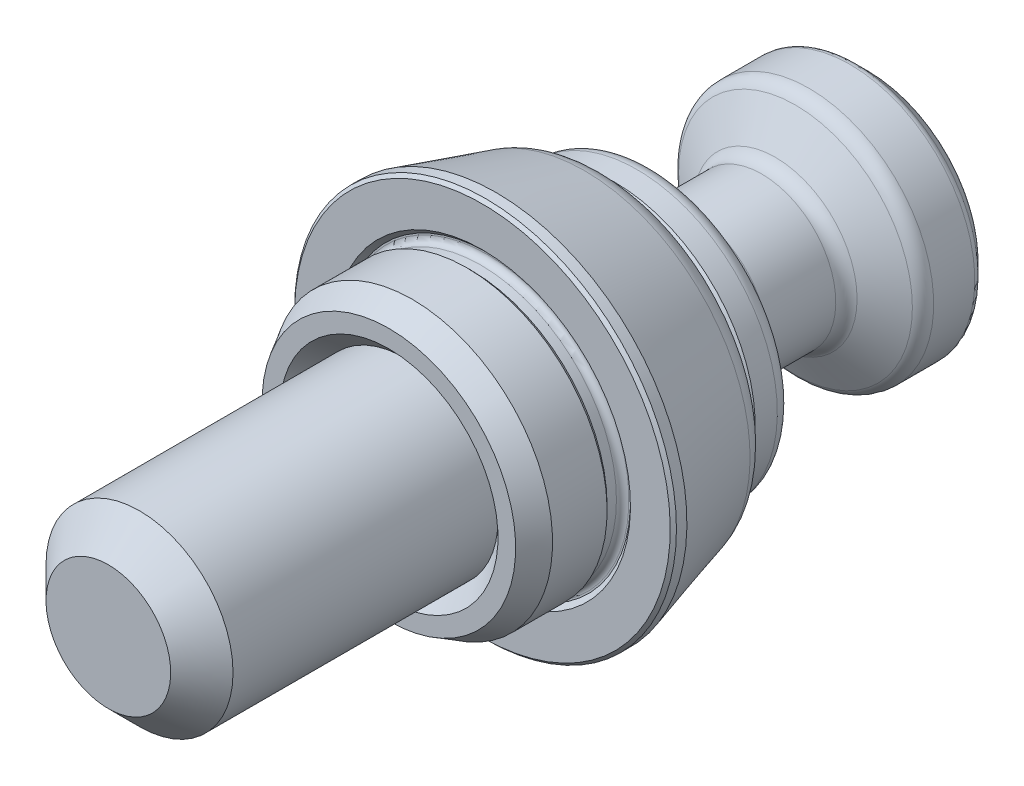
ISO-10303-21;
HEADER;
FILE_DESCRIPTION(('STEP AP214'),'2;1');
FILE_NAME('part.step','',(''),(''),'','','');
FILE_SCHEMA(('AUTOMOTIVE_DESIGN { 1 0 10303 214 1 1 1 1 }'));
ENDSEC;
DATA;
#1=APPLICATION_CONTEXT('core data for automotive mechanical design processes');
#2=APPLICATION_PROTOCOL_DEFINITION('international standard','automotive_design',2000,#1);
#3=PRODUCT_CONTEXT('',#1,'mechanical');
#4=PRODUCT('Part','Part','',(#3));
#5=PRODUCT_RELATED_PRODUCT_CATEGORY('part','',(#4));
#6=PRODUCT_DEFINITION_FORMATION('','',#4);
#7=PRODUCT_DEFINITION_CONTEXT('part definition',#1,'design');
#8=PRODUCT_DEFINITION('design','',#6,#7);
#9=PRODUCT_DEFINITION_SHAPE('','',#8);
#10=(LENGTH_UNIT() NAMED_UNIT(*) SI_UNIT(.MILLI.,.METRE.));
#11=(NAMED_UNIT(*) PLANE_ANGLE_UNIT() SI_UNIT($,.RADIAN.));
#12=(NAMED_UNIT(*) SI_UNIT($,.STERADIAN.) SOLID_ANGLE_UNIT());
#13=UNCERTAINTY_MEASURE_WITH_UNIT(LENGTH_MEASURE(1.E-05),#10,'distance_accuracy_value','');
#14=(GEOMETRIC_REPRESENTATION_CONTEXT(3) GLOBAL_UNCERTAINTY_ASSIGNED_CONTEXT((#13)) GLOBAL_UNIT_ASSIGNED_CONTEXT((#10,
#11,#12)) REPRESENTATION_CONTEXT('',''));
#15=CARTESIAN_POINT('',(0.,0.,0.));
#16=DIRECTION('',(0.,0.,1.));
#17=DIRECTION('',(1.,0.,0.));
#18=AXIS2_PLACEMENT_3D('',#15,#16,#17);
#19=CARTESIAN_POINT('',(6.,0.,-8.));
#20=DIRECTION('',(0.,0.,-1.));
#21=DIRECTION('',(0.,1.,0.));
#22=AXIS2_PLACEMENT_3D('',#19,#20,#21);
#23=PLANE('',#22);
#24=CARTESIAN_POINT('',(0.,0.,-8.));
#25=DIRECTION('',(0.,0.,1.));
#26=DIRECTION('',(0.,1.,0.));
#27=AXIS2_PLACEMENT_3D('',#24,#25,#26);
#28=CIRCLE('',#27,8.5);
#29=CARTESIAN_POINT('',(0.,8.5,-8.));
#30=VERTEX_POINT('',#29);
#31=EDGE_CURVE('E91',#30,#30,#28,.T.);
#32=ORIENTED_EDGE('',*,*,#31,.T.);
#33=EDGE_LOOP('',(#32));
#34=FACE_BOUND('',#33,.T.);
#35=CARTESIAN_POINT('',(0.,0.,-8.));
#36=DIRECTION('',(0.,0.,-1.));
#37=DIRECTION('',(0.,1.,0.));
#38=AXIS2_PLACEMENT_3D('',#35,#36,#37);
#39=CIRCLE('',#38,8.69892881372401);
#40=CARTESIAN_POINT('',(0.,8.69892881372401,-8.));
#41=VERTEX_POINT('',#40);
#42=EDGE_CURVE('E166',#41,#41,#39,.T.);
#43=ORIENTED_EDGE('',*,*,#42,.T.);
#44=EDGE_LOOP('',(#43));
#45=FACE_BOUND('',#44,.T.);
#46=ADVANCED_FACE('F14',(#34,#45),#23,.T.);
#47=CARTESIAN_POINT('',(0.,0.,-6.));
#48=DIRECTION('',(0.,0.,-1.));
#49=DIRECTION('',(0.,1.,0.));
#50=AXIS2_PLACEMENT_3D('',#47,#48,#49);
#51=TOROIDAL_SURFACE('',#50,8.69892881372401,2.);
#52=CARTESIAN_POINT('',(0.,0.,-6.55127471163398));
#53=DIRECTION('',(0.,0.,-1.));
#54=DIRECTION('',(0.,1.,0.));
#55=AXIS2_PLACEMENT_3D('',#52,#53,#54);
#56=CIRCLE('',#55,10.6214522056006);
#57=CARTESIAN_POINT('',(0.,10.6214522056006,-6.55127471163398));
#58=VERTEX_POINT('',#57);
#59=EDGE_CURVE('E169',#58,#58,#56,.F.);
#60=ORIENTED_EDGE('',*,*,#59,.F.);
#61=EDGE_LOOP('',(#60));
#62=FACE_BOUND('',#61,.T.);
#63=ORIENTED_EDGE('',*,*,#42,.F.);
#64=EDGE_LOOP('',(#63));
#65=FACE_BOUND('',#64,.T.);
#66=ADVANCED_FACE('F308',(#62,#65),#51,.T.);
#67=CARTESIAN_POINT('',(0.,0.,-8.));
#68=DIRECTION('',(0.,0.,1.));
#69=DIRECTION('',(0.,-1.,0.));
#70=AXIS2_PLACEMENT_3D('',#67,#68,#69);
#71=CONICAL_SURFACE('',#70,10.2060369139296,0.279252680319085);
#72=ORIENTED_EDGE('',*,*,#59,.T.);
#73=EDGE_LOOP('',(#72));
#74=FACE_BOUND('',#73,.T.);
#75=CARTESIAN_POINT('',(0.,0.,-0.871853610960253));
#76=DIRECTION('',(0.,0.,-1.));
#77=DIRECTION('',(0.,1.,0.));
#78=AXIS2_PLACEMENT_3D('',#75,#76,#77);
#79=CIRCLE('',#78,12.25);
#80=CARTESIAN_POINT('',(0.,12.25,-0.871853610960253));
#81=VERTEX_POINT('',#80);
#82=EDGE_CURVE('E163',#81,#81,#79,.T.);
#83=ORIENTED_EDGE('',*,*,#82,.T.);
#84=EDGE_LOOP('',(#83));
#85=FACE_BOUND('',#84,.T.);
#86=ADVANCED_FACE('F312',(#74,#85),#71,.T.);
#87=CARTESIAN_POINT('',(0.,0.,0.));
#88=DIRECTION('',(0.,0.,-1.));
#89=DIRECTION('',(0.,1.,0.));
#90=AXIS2_PLACEMENT_3D('',#87,#88,#89);
#91=CYLINDRICAL_SURFACE('',#90,12.25);
#92=CARTESIAN_POINT('',(0.,0.,-0.2));
#93=DIRECTION('',(0.,0.,1.));
#94=DIRECTION('',(0.,-1.,0.));
#95=AXIS2_PLACEMENT_3D('',#92,#93,#94);
#96=CIRCLE('',#95,12.25);
#97=CARTESIAN_POINT('',(0.,-12.25,-0.2));
#98=VERTEX_POINT('',#97);
#99=EDGE_CURVE('E181',#98,#98,#96,.F.);
#100=ORIENTED_EDGE('',*,*,#99,.T.);
#101=EDGE_LOOP('',(#100));
#102=FACE_BOUND('',#101,.T.);
#103=ORIENTED_EDGE('',*,*,#82,.F.);
#104=EDGE_LOOP('',(#103));
#105=FACE_BOUND('',#104,.T.);
#106=ADVANCED_FACE('F315',(#102,#105),#91,.T.);
#107=CARTESIAN_POINT('',(0.,0.,-0.2));
#108=DIRECTION('',(0.,0.,-1.));
#109=DIRECTION('',(0.,1.,0.));
#110=AXIS2_PLACEMENT_3D('',#107,#108,#109);
#111=CONICAL_SURFACE('',#110,12.25,0.785398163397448);
#112=CARTESIAN_POINT('',(0.,0.,0.));
#113=DIRECTION('',(0.,0.,1.));
#114=DIRECTION('',(0.,-1.,0.));
#115=AXIS2_PLACEMENT_3D('',#112,#113,#114);
#116=CIRCLE('',#115,12.05);
#117=CARTESIAN_POINT('',(0.,-12.05,0.));
#118=VERTEX_POINT('',#117);
#119=EDGE_CURVE('E184',#118,#118,#116,.T.);
#120=ORIENTED_EDGE('',*,*,#119,.F.);
#121=EDGE_LOOP('',(#120));
#122=FACE_BOUND('',#121,.T.);
#123=ORIENTED_EDGE('',*,*,#99,.F.);
#124=EDGE_LOOP('',(#123));
#125=FACE_BOUND('',#124,.T.);
#126=ADVANCED_FACE('F303',(#122,#125),#111,.T.);
#127=CARTESIAN_POINT('',(9.,0.,0.));
#128=DIRECTION('',(0.,0.,1.));
#129=DIRECTION('',(0.,-1.,0.));
#130=AXIS2_PLACEMENT_3D('',#127,#128,#129);
#131=PLANE('',#130);
#132=CARTESIAN_POINT('',(0.,0.,0.));
#133=DIRECTION('',(0.,0.,-1.));
#134=DIRECTION('',(0.,1.,0.));
#135=AXIS2_PLACEMENT_3D('',#132,#133,#134);
#136=CIRCLE('',#135,9.5);
#137=CARTESIAN_POINT('',(0.,9.5,0.));
#138=VERTEX_POINT('',#137);
#139=EDGE_CURVE('E160',#138,#138,#136,.T.);
#140=ORIENTED_EDGE('',*,*,#139,.T.);
#141=EDGE_LOOP('',(#140));
#142=FACE_BOUND('',#141,.T.);
#143=ORIENTED_EDGE('',*,*,#119,.T.);
#144=EDGE_LOOP('',(#143));
#145=FACE_BOUND('',#144,.T.);
#146=ADVANCED_FACE('F292',(#142,#145),#131,.T.);
#147=CARTESIAN_POINT('',(0.,0.,-0.3));
#148=DIRECTION('',(0.,0.,1.));
#149=DIRECTION('',(0.,-1.,0.));
#150=AXIS2_PLACEMENT_3D('',#147,#148,#149);
#151=CONICAL_SURFACE('',#150,9.2,0.785398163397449);
#152=ORIENTED_EDGE('',*,*,#139,.F.);
#153=EDGE_LOOP('',(#152));
#154=FACE_BOUND('',#153,.T.);
#155=CARTESIAN_POINT('',(0.,0.,-0.3));
#156=DIRECTION('',(0.,0.,-1.));
#157=DIRECTION('',(0.,1.,0.));
#158=AXIS2_PLACEMENT_3D('',#155,#156,#157);
#159=CIRCLE('',#158,9.2);
#160=CARTESIAN_POINT('',(0.,9.2,-0.3));
#161=VERTEX_POINT('',#160);
#162=EDGE_CURVE('E157',#161,#161,#159,.T.);
#163=ORIENTED_EDGE('',*,*,#162,.T.);
#164=EDGE_LOOP('',(#163));
#165=FACE_BOUND('',#164,.T.);
#166=ADVANCED_FACE('F277',(#154,#165),#151,.F.);
#167=CARTESIAN_POINT('',(0.,0.,6.));
#168=DIRECTION('',(0.,0.,1.));
#169=DIRECTION('',(0.,-1.,0.));
#170=AXIS2_PLACEMENT_3D('',#167,#168,#169);
#171=CONICAL_SURFACE('',#170,7.,0.785398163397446);
#172=CARTESIAN_POINT('',(0.,0.,5.));
#173=DIRECTION('',(0.,0.,1.));
#174=DIRECTION('',(0.,-1.,0.));
#175=AXIS2_PLACEMENT_3D('',#172,#173,#174);
#176=CIRCLE('',#175,6.);
#177=CARTESIAN_POINT('',(0.,-6.,5.));
#178=VERTEX_POINT('',#177);
#179=EDGE_CURVE('E9',#178,#178,#176,.F.);
#180=ORIENTED_EDGE('',*,*,#179,.T.);
#181=EDGE_LOOP('',(#180));
#182=FACE_BOUND('',#181,.T.);
#183=CARTESIAN_POINT('',(0.,0.,6.));
#184=DIRECTION('',(0.,0.,1.));
#185=DIRECTION('',(0.,-1.,0.));
#186=AXIS2_PLACEMENT_3D('',#183,#184,#185);
#187=CIRCLE('',#186,7.);
#188=CARTESIAN_POINT('',(0.,-7.,6.));
#189=VERTEX_POINT('',#188);
#190=EDGE_CURVE('E178',#189,#189,#187,.F.);
#191=ORIENTED_EDGE('',*,*,#190,.F.);
#192=EDGE_LOOP('',(#191));
#193=FACE_BOUND('',#192,.T.);
#194=ADVANCED_FACE('F301',(#182,#193),#171,.F.);
#195=CARTESIAN_POINT('',(6.,0.,6.));
#196=DIRECTION('',(0.,0.,1.));
#197=DIRECTION('',(0.,-1.,0.));
#198=AXIS2_PLACEMENT_3D('',#195,#196,#197);
#199=PLANE('',#198);
#200=ORIENTED_EDGE('',*,*,#190,.T.);
#201=EDGE_LOOP('',(#200));
#202=FACE_BOUND('',#201,.T.);
#203=CARTESIAN_POINT('',(0.,0.,6.));
#204=DIRECTION('',(0.,0.,1.));
#205=DIRECTION('',(0.,-1.,0.));
#206=AXIS2_PLACEMENT_3D('',#203,#204,#205);
#207=CIRCLE('',#206,8.13397459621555);
#208=CARTESIAN_POINT('',(0.,-8.13397459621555,6.));
#209=VERTEX_POINT('',#208);
#210=EDGE_CURVE('E175',#209,#209,#207,.T.);
#211=ORIENTED_EDGE('',*,*,#210,.T.);
#212=EDGE_LOOP('',(#211));
#213=FACE_BOUND('',#212,.T.);
#214=ADVANCED_FACE('F304',(#202,#213),#199,.T.);
#215=CARTESIAN_POINT('',(0.,0.,4.5));
#216=DIRECTION('',(0.,0.,-1.));
#217=DIRECTION('',(0.,1.,0.));
#218=AXIS2_PLACEMENT_3D('',#215,#216,#217);
#219=CONICAL_SURFACE('',#218,9.,0.523598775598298);
#220=ORIENTED_EDGE('',*,*,#210,.F.);
#221=EDGE_LOOP('',(#220));
#222=FACE_BOUND('',#221,.T.);
#223=CARTESIAN_POINT('',(0.,0.,4.5));
#224=DIRECTION('',(0.,0.,1.));
#225=DIRECTION('',(0.,-1.,0.));
#226=AXIS2_PLACEMENT_3D('',#223,#224,#225);
#227=CIRCLE('',#226,9.);
#228=CARTESIAN_POINT('',(0.,-9.,4.5));
#229=VERTEX_POINT('',#228);
#230=EDGE_CURVE('E172',#229,#229,#227,.F.);
#231=ORIENTED_EDGE('',*,*,#230,.F.);
#232=EDGE_LOOP('',(#231));
#233=FACE_BOUND('',#232,.T.);
#234=ADVANCED_FACE('F288',(#222,#233),#219,.T.);
#235=CARTESIAN_POINT('',(0.,0.,0.));
#236=DIRECTION('',(0.,0.,-1.));
#237=DIRECTION('',(0.,1.,0.));
#238=AXIS2_PLACEMENT_3D('',#235,#236,#237);
#239=CYLINDRICAL_SURFACE('',#238,9.);
#240=CARTESIAN_POINT('',(0.,0.,1.));
#241=DIRECTION('',(0.,0.,-1.));
#242=DIRECTION('',(0.,1.,0.));
#243=AXIS2_PLACEMENT_3D('',#240,#241,#242);
#244=CIRCLE('',#243,9.);
#245=CARTESIAN_POINT('',(0.,9.,1.));
#246=VERTEX_POINT('',#245);
#247=EDGE_CURVE('E151',#246,#246,#244,.T.);
#248=ORIENTED_EDGE('',*,*,#247,.F.);
#249=EDGE_LOOP('',(#248));
#250=FACE_BOUND('',#249,.T.);
#251=ORIENTED_EDGE('',*,*,#230,.T.);
#252=EDGE_LOOP('',(#251));
#253=FACE_BOUND('',#252,.T.);
#254=ADVANCED_FACE('F281',(#250,#253),#239,.T.);
#255=CARTESIAN_POINT('',(0.,0.,1.));
#256=DIRECTION('',(0.,0.,1.));
#257=DIRECTION('',(0.,-1.,0.));
#258=AXIS2_PLACEMENT_3D('',#255,#256,#257);
#259=CONICAL_SURFACE('',#258,9.,0.78539816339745);
#260=CARTESIAN_POINT('',(0.,0.,0.7));
#261=DIRECTION('',(0.,0.,-1.));
#262=DIRECTION('',(0.,1.,0.));
#263=AXIS2_PLACEMENT_3D('',#260,#261,#262);
#264=CIRCLE('',#263,8.7);
#265=CARTESIAN_POINT('',(0.,8.7,0.7));
#266=VERTEX_POINT('',#265);
#267=EDGE_CURVE('E154',#266,#266,#264,.T.);
#268=ORIENTED_EDGE('',*,*,#267,.F.);
#269=EDGE_LOOP('',(#268));
#270=FACE_BOUND('',#269,.T.);
#271=ORIENTED_EDGE('',*,*,#247,.T.);
#272=EDGE_LOOP('',(#271));
#273=FACE_BOUND('',#272,.T.);
#274=ADVANCED_FACE('F269',(#270,#273),#259,.T.);
#275=CARTESIAN_POINT('',(0.,0.,0.));
#276=DIRECTION('',(0.,0.,-1.));
#277=DIRECTION('',(0.,1.,0.));
#278=AXIS2_PLACEMENT_3D('',#275,#276,#277);
#279=CYLINDRICAL_SURFACE('',#278,8.7);
#280=CARTESIAN_POINT('',(0.,0.,0.1));
#281=DIRECTION('',(0.,0.,-1.));
#282=DIRECTION('',(0.,1.,0.));
#283=AXIS2_PLACEMENT_3D('',#280,#281,#282);
#284=CIRCLE('',#283,8.7);
#285=CARTESIAN_POINT('',(0.,8.7,0.1));
#286=VERTEX_POINT('',#285);
#287=EDGE_CURVE('E18',#286,#286,#284,.F.);
#288=ORIENTED_EDGE('',*,*,#287,.T.);
#289=EDGE_LOOP('',(#288));
#290=FACE_BOUND('',#289,.T.);
#291=ORIENTED_EDGE('',*,*,#267,.T.);
#292=EDGE_LOOP('',(#291));
#293=FACE_BOUND('',#292,.T.);
#294=ADVANCED_FACE('F267',(#290,#293),#279,.T.);
#295=CARTESIAN_POINT('',(0.,0.,0.1));
#296=DIRECTION('',(0.,0.,-1.));
#297=DIRECTION('',(0.,1.,0.));
#298=AXIS2_PLACEMENT_3D('',#295,#296,#297);
#299=TOROIDAL_SURFACE('',#298,9.1,0.4);
#300=ORIENTED_EDGE('',*,*,#287,.F.);
#301=EDGE_LOOP('',(#300));
#302=FACE_BOUND('',#301,.T.);
#303=CARTESIAN_POINT('',(0.,0.,-0.3));
#304=DIRECTION('',(0.,0.,-1.));
#305=DIRECTION('',(0.,1.,0.));
#306=AXIS2_PLACEMENT_3D('',#303,#304,#305);
#307=CIRCLE('',#306,9.1);
#308=CARTESIAN_POINT('',(0.,9.1,-0.3));
#309=VERTEX_POINT('',#308);
#310=EDGE_CURVE('E186',#309,#309,#307,.T.);
#311=ORIENTED_EDGE('',*,*,#310,.F.);
#312=EDGE_LOOP('',(#311));
#313=FACE_BOUND('',#312,.T.);
#314=ADVANCED_FACE('F16',(#302,#313),#299,.F.);
#315=CARTESIAN_POINT('',(8.7,0.,-0.3));
#316=DIRECTION('',(0.,0.,-1.));
#317=DIRECTION('',(0.,1.,0.));
#318=AXIS2_PLACEMENT_3D('',#315,#316,#317);
#319=PLANE('',#318);
#320=ORIENTED_EDGE('',*,*,#310,.T.);
#321=EDGE_LOOP('',(#320));
#322=FACE_BOUND('',#321,.T.);
#323=ORIENTED_EDGE('',*,*,#162,.F.);
#324=EDGE_LOOP('',(#323));
#325=FACE_BOUND('',#324,.T.);
#326=ADVANCED_FACE('F266',(#322,#325),#319,.F.);
#327=CARTESIAN_POINT('',(0.,0.,-8.));
#328=DIRECTION('',(0.,0.,-1.));
#329=DIRECTION('',(0.,-1.,0.));
#330=AXIS2_PLACEMENT_3D('',#327,#328,#329);
#331=CYLINDRICAL_SURFACE('',#330,6.);
#332=ORIENTED_EDGE('',*,*,#179,.F.);
#333=EDGE_LOOP('',(#332));
#334=FACE_BOUND('',#333,.T.);
#335=CARTESIAN_POINT('',(0.,0.,22.));
#336=DIRECTION('',(0.,0.,1.));
#337=DIRECTION('',(0.,1.,0.));
#338=AXIS2_PLACEMENT_3D('',#335,#336,#337);
#339=CIRCLE('',#338,6.);
#340=CARTESIAN_POINT('',(0.,6.,22.));
#341=VERTEX_POINT('',#340);
#342=EDGE_CURVE('E128',#341,#341,#339,.F.);
#343=ORIENTED_EDGE('',*,*,#342,.T.);
#344=EDGE_LOOP('',(#343));
#345=FACE_BOUND('',#344,.T.);
#346=ADVANCED_FACE('F275',(#334,#345),#331,.T.);
#347=CARTESIAN_POINT('',(0.,0.,22.));
#348=DIRECTION('',(0.,0.,-1.));
#349=DIRECTION('',(0.,-1.,0.));
#350=AXIS2_PLACEMENT_3D('',#347,#348,#349);
#351=CONICAL_SURFACE('',#350,6.,0.785398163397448);
#352=CARTESIAN_POINT('',(0.,0.,24.));
#353=DIRECTION('',(0.,0.,1.));
#354=DIRECTION('',(0.,1.,0.));
#355=AXIS2_PLACEMENT_3D('',#352,#353,#354);
#356=CIRCLE('',#355,4.);
#357=CARTESIAN_POINT('',(0.,4.,24.));
#358=VERTEX_POINT('',#357);
#359=EDGE_CURVE('E131',#358,#358,#356,.T.);
#360=ORIENTED_EDGE('',*,*,#359,.F.);
#361=EDGE_LOOP('',(#360));
#362=FACE_BOUND('',#361,.T.);
#363=ORIENTED_EDGE('',*,*,#342,.F.);
#364=EDGE_LOOP('',(#363));
#365=FACE_BOUND('',#364,.T.);
#366=ADVANCED_FACE('F560',(#362,#365),#351,.T.);
#367=CARTESIAN_POINT('',(0.,0.,24.));
#368=DIRECTION('',(0.,0.,1.));
#369=DIRECTION('',(0.,1.,0.));
#370=AXIS2_PLACEMENT_3D('',#367,#368,#369);
#371=PLANE('',#370);
#372=ORIENTED_EDGE('',*,*,#359,.T.);
#373=EDGE_LOOP('',(#372));
#374=FACE_BOUND('',#373,.T.);
#375=ADVANCED_FACE('F291',(#374),#371,.T.);
#376=CARTESIAN_POINT('',(0.,0.,-8.5));
#377=DIRECTION('',(0.,0.,-1.));
#378=DIRECTION('',(0.,-1.,0.));
#379=AXIS2_PLACEMENT_3D('',#376,#377,#378);
#380=CONICAL_SURFACE('',#379,9.,0.785398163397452);
#381=ORIENTED_EDGE('',*,*,#31,.F.);
#382=EDGE_LOOP('',(#381));
#383=FACE_BOUND('',#382,.T.);
#384=CARTESIAN_POINT('',(0.,0.,-8.5));
#385=DIRECTION('',(0.,0.,1.));
#386=DIRECTION('',(0.,1.,0.));
#387=AXIS2_PLACEMENT_3D('',#384,#385,#386);
#388=CIRCLE('',#387,9.);
#389=CARTESIAN_POINT('',(0.,9.,-8.5));
#390=VERTEX_POINT('',#389);
#391=EDGE_CURVE('E88',#390,#390,#388,.F.);
#392=ORIENTED_EDGE('',*,*,#391,.F.);
#393=EDGE_LOOP('',(#392));
#394=FACE_BOUND('',#393,.T.);
#395=ADVANCED_FACE('F543',(#383,#394),#380,.T.);
#396=CARTESIAN_POINT('',(0.,0.,-8.));
#397=DIRECTION('',(0.,0.,-1.));
#398=DIRECTION('',(0.,-1.,0.));
#399=AXIS2_PLACEMENT_3D('',#396,#397,#398);
#400=CYLINDRICAL_SURFACE('',#399,9.);
#401=CARTESIAN_POINT('',(0.,0.,-9.92264973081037));
#402=DIRECTION('',(0.,0.,-1.));
#403=DIRECTION('',(0.,-1.,0.));
#404=AXIS2_PLACEMENT_3D('',#401,#402,#403);
#405=CIRCLE('',#404,9.);
#406=CARTESIAN_POINT('',(0.,-9.,-9.92264973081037));
#407=VERTEX_POINT('',#406);
#408=EDGE_CURVE('E140',#407,#407,#405,.F.);
#409=ORIENTED_EDGE('',*,*,#408,.T.);
#410=EDGE_LOOP('',(#409));
#411=FACE_BOUND('',#410,.T.);
#412=ORIENTED_EDGE('',*,*,#391,.T.);
#413=EDGE_LOOP('',(#412));
#414=FACE_BOUND('',#413,.T.);
#415=ADVANCED_FACE('F535',(#411,#414),#400,.T.);
#416=CARTESIAN_POINT('',(0.,0.,-9.92264973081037));
#417=DIRECTION('',(0.,0.,-1.));
#418=DIRECTION('',(0.,-1.,0.));
#419=AXIS2_PLACEMENT_3D('',#416,#417,#418);
#420=TOROIDAL_SURFACE('',#419,8.,1.);
#421=CARTESIAN_POINT('',(0.,0.,-10.7886751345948));
#422=DIRECTION('',(0.,0.,-1.));
#423=DIRECTION('',(0.,-1.,0.));
#424=AXIS2_PLACEMENT_3D('',#421,#422,#423);
#425=CIRCLE('',#424,8.5);
#426=CARTESIAN_POINT('',(0.,-8.5,-10.7886751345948));
#427=VERTEX_POINT('',#426);
#428=EDGE_CURVE('E143',#427,#427,#425,.T.);
#429=ORIENTED_EDGE('',*,*,#428,.F.);
#430=EDGE_LOOP('',(#429));
#431=FACE_BOUND('',#430,.T.);
#432=ORIENTED_EDGE('',*,*,#408,.F.);
#433=EDGE_LOOP('',(#432));
#434=FACE_BOUND('',#433,.T.);
#435=ADVANCED_FACE('F527',(#431,#434),#420,.T.);
#436=CARTESIAN_POINT('',(0.,0.,-10.5));
#437=DIRECTION('',(0.,0.,1.));
#438=DIRECTION('',(0.,1.,0.));
#439=AXIS2_PLACEMENT_3D('',#436,#437,#438);
#440=CONICAL_SURFACE('',#439,9.,1.0471975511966);
#441=ORIENTED_EDGE('',*,*,#428,.T.);
#442=EDGE_LOOP('',(#441));
#443=FACE_BOUND('',#442,.T.);
#444=CARTESIAN_POINT('',(0.,0.,-12.6650635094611));
#445=DIRECTION('',(0.,0.,1.));
#446=DIRECTION('',(0.,1.,0.));
#447=AXIS2_PLACEMENT_3D('',#444,#445,#446);
#448=CIRCLE('',#447,5.25);
#449=CARTESIAN_POINT('',(0.,5.25,-12.6650635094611));
#450=VERTEX_POINT('',#449);
#451=EDGE_CURVE('E119',#450,#450,#448,.T.);
#452=ORIENTED_EDGE('',*,*,#451,.T.);
#453=EDGE_LOOP('',(#452));
#454=FACE_BOUND('',#453,.T.);
#455=ADVANCED_FACE('F518',(#443,#454),#440,.T.);
#456=CARTESIAN_POINT('',(0.,0.,-13.5310889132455));
#457=DIRECTION('',(0.,0.,1.));
#458=DIRECTION('',(0.,1.,0.));
#459=AXIS2_PLACEMENT_3D('',#456,#457,#458);
#460=TOROIDAL_SURFACE('',#459,5.75,1.);
#461=CARTESIAN_POINT('',(0.,0.,-13.5310889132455));
#462=DIRECTION('',(0.,0.,1.));
#463=DIRECTION('',(0.,1.,0.));
#464=AXIS2_PLACEMENT_3D('',#461,#462,#463);
#465=CIRCLE('',#464,4.75);
#466=CARTESIAN_POINT('',(0.,4.75,-13.5310889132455));
#467=VERTEX_POINT('',#466);
#468=EDGE_CURVE('E110',#467,#467,#465,.F.);
#469=ORIENTED_EDGE('',*,*,#468,.F.);
#470=EDGE_LOOP('',(#469));
#471=FACE_BOUND('',#470,.T.);
#472=ORIENTED_EDGE('',*,*,#451,.F.);
#473=EDGE_LOOP('',(#472));
#474=FACE_BOUND('',#473,.T.);
#475=ADVANCED_FACE('F509',(#471,#474),#460,.F.);
#476=CARTESIAN_POINT('',(0.,0.,-8.));
#477=DIRECTION('',(0.,0.,1.));
#478=DIRECTION('',(0.,1.,0.));
#479=AXIS2_PLACEMENT_3D('',#476,#477,#478);
#480=CYLINDRICAL_SURFACE('',#479,4.75);
#481=CARTESIAN_POINT('',(0.,0.,-17.9226497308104));
#482=DIRECTION('',(0.,0.,1.));
#483=DIRECTION('',(0.,1.,0.));
#484=AXIS2_PLACEMENT_3D('',#481,#482,#483);
#485=CIRCLE('',#484,4.75);
#486=CARTESIAN_POINT('',(0.,4.75,-17.9226497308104));
#487=VERTEX_POINT('',#486);
#488=EDGE_CURVE('E113',#487,#487,#485,.T.);
#489=ORIENTED_EDGE('',*,*,#488,.T.);
#490=EDGE_LOOP('',(#489));
#491=FACE_BOUND('',#490,.T.);
#492=ORIENTED_EDGE('',*,*,#468,.T.);
#493=EDGE_LOOP('',(#492));
#494=FACE_BOUND('',#493,.T.);
#495=ADVANCED_FACE('F500',(#491,#494),#480,.T.);
#496=CARTESIAN_POINT('',(0.,0.,-17.9226497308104));
#497=DIRECTION('',(0.,0.,1.));
#498=DIRECTION('',(0.,1.,0.));
#499=AXIS2_PLACEMENT_3D('',#496,#497,#498);
#500=TOROIDAL_SURFACE('',#499,5.75,1.);
#501=CARTESIAN_POINT('',(0.,0.,-18.7886751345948));
#502=DIRECTION('',(0.,0.,-1.));
#503=DIRECTION('',(0.,-1.,0.));
#504=AXIS2_PLACEMENT_3D('',#501,#502,#503);
#505=CIRCLE('',#504,5.25);
#506=CARTESIAN_POINT('',(0.,-5.25,-18.7886751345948));
#507=VERTEX_POINT('',#506);
#508=EDGE_CURVE('E116',#507,#507,#505,.T.);
#509=ORIENTED_EDGE('',*,*,#508,.F.);
#510=EDGE_LOOP('',(#509));
#511=FACE_BOUND('',#510,.T.);
#512=ORIENTED_EDGE('',*,*,#488,.F.);
#513=EDGE_LOOP('',(#512));
#514=FACE_BOUND('',#513,.T.);
#515=ADVANCED_FACE('F491',(#511,#514),#500,.F.);
#516=CARTESIAN_POINT('',(0.,0.,-18.5));
#517=DIRECTION('',(0.,0.,-1.));
#518=DIRECTION('',(0.,-1.,0.));
#519=AXIS2_PLACEMENT_3D('',#516,#517,#518);
#520=CONICAL_SURFACE('',#519,4.75,1.0471975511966);
#521=CARTESIAN_POINT('',(0.,0.,-20.0877132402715));
#522=DIRECTION('',(0.,0.,1.));
#523=DIRECTION('',(0.,1.,0.));
#524=AXIS2_PLACEMENT_3D('',#521,#522,#523);
#525=CIRCLE('',#524,7.5);
#526=CARTESIAN_POINT('',(0.,7.5,-20.0877132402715));
#527=VERTEX_POINT('',#526);
#528=EDGE_CURVE('E146',#527,#527,#525,.T.);
#529=ORIENTED_EDGE('',*,*,#528,.T.);
#530=EDGE_LOOP('',(#529));
#531=FACE_BOUND('',#530,.T.);
#532=ORIENTED_EDGE('',*,*,#508,.T.);
#533=EDGE_LOOP('',(#532));
#534=FACE_BOUND('',#533,.T.);
#535=ADVANCED_FACE('F483',(#531,#534),#520,.T.);
#536=CARTESIAN_POINT('',(0.,0.,-20.9537386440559));
#537=DIRECTION('',(0.,0.,-1.));
#538=DIRECTION('',(0.,-1.,0.));
#539=AXIS2_PLACEMENT_3D('',#536,#537,#538);
#540=TOROIDAL_SURFACE('',#539,7.,1.);
#541=CARTESIAN_POINT('',(0.,0.,-20.9537386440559));
#542=DIRECTION('',(0.,0.,-1.));
#543=DIRECTION('',(0.,-1.,0.));
#544=AXIS2_PLACEMENT_3D('',#541,#542,#543);
#545=CIRCLE('',#544,8.);
#546=CARTESIAN_POINT('',(0.,-8.,-20.9537386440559));
#547=VERTEX_POINT('',#546);
#548=EDGE_CURVE('E23',#547,#547,#545,.T.);
#549=ORIENTED_EDGE('',*,*,#548,.F.);
#550=EDGE_LOOP('',(#549));
#551=FACE_BOUND('',#550,.T.);
#552=ORIENTED_EDGE('',*,*,#528,.F.);
#553=EDGE_LOOP('',(#552));
#554=FACE_BOUND('',#553,.T.);
#555=ADVANCED_FACE('F296',(#551,#554),#540,.T.);
#556=CARTESIAN_POINT('',(0.,0.,-8.));
#557=DIRECTION('',(0.,0.,1.));
#558=DIRECTION('',(0.,1.,0.));
#559=AXIS2_PLACEMENT_3D('',#556,#557,#558);
#560=CYLINDRICAL_SURFACE('',#559,8.);
#561=ORIENTED_EDGE('',*,*,#548,.T.);
#562=EDGE_LOOP('',(#561));
#563=FACE_BOUND('',#562,.T.);
#564=CARTESIAN_POINT('',(0.,0.,-23.5928932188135));
#565=DIRECTION('',(0.,0.,-1.));
#566=DIRECTION('',(0.,-1.,0.));
#567=AXIS2_PLACEMENT_3D('',#564,#565,#566);
#568=CIRCLE('',#567,8.);
#569=CARTESIAN_POINT('',(0.,-8.,-23.5928932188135));
#570=VERTEX_POINT('',#569);
#571=EDGE_CURVE('E122',#570,#570,#568,.F.);
#572=ORIENTED_EDGE('',*,*,#571,.T.);
#573=EDGE_LOOP('',(#572));
#574=FACE_BOUND('',#573,.T.);
#575=ADVANCED_FACE('F466',(#563,#574),#560,.T.);
#576=CARTESIAN_POINT('',(0.,0.,-23.5928932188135));
#577=DIRECTION('',(0.,0.,-1.));
#578=DIRECTION('',(0.,-1.,0.));
#579=AXIS2_PLACEMENT_3D('',#576,#577,#578);
#580=TOROIDAL_SURFACE('',#579,7.5,0.5);
#581=CARTESIAN_POINT('',(0.,0.,-23.9464466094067));
#582=DIRECTION('',(0.,0.,-1.));
#583=DIRECTION('',(0.,-1.,0.));
#584=AXIS2_PLACEMENT_3D('',#581,#582,#583);
#585=CIRCLE('',#584,7.85355339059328);
#586=CARTESIAN_POINT('',(0.,-7.85355339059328,-23.9464466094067));
#587=VERTEX_POINT('',#586);
#588=EDGE_CURVE('E125',#587,#587,#585,.T.);
#589=ORIENTED_EDGE('',*,*,#588,.F.);
#590=EDGE_LOOP('',(#589));
#591=FACE_BOUND('',#590,.T.);
#592=ORIENTED_EDGE('',*,*,#571,.F.);
#593=EDGE_LOOP('',(#592));
#594=FACE_BOUND('',#593,.T.);
#595=ADVANCED_FACE('F458',(#591,#594),#580,.T.);
#596=CARTESIAN_POINT('',(0.,0.,-23.8));
#597=DIRECTION('',(0.,0.,1.));
#598=DIRECTION('',(0.,1.,0.));
#599=AXIS2_PLACEMENT_3D('',#596,#597,#598);
#600=CONICAL_SURFACE('',#599,8.,0.785398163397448);
#601=CARTESIAN_POINT('',(0.,0.,-24.7071067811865));
#602=DIRECTION('',(0.,0.,-1.));
#603=DIRECTION('',(0.,-1.,0.));
#604=AXIS2_PLACEMENT_3D('',#601,#602,#603);
#605=CIRCLE('',#604,7.09289321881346);
#606=CARTESIAN_POINT('',(0.,-7.09289321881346,-24.7071067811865));
#607=VERTEX_POINT('',#606);
#608=EDGE_CURVE('E134',#607,#607,#605,.F.);
#609=ORIENTED_EDGE('',*,*,#608,.T.);
#610=EDGE_LOOP('',(#609));
#611=FACE_BOUND('',#610,.T.);
#612=ORIENTED_EDGE('',*,*,#588,.T.);
#613=EDGE_LOOP('',(#612));
#614=FACE_BOUND('',#613,.T.);
#615=ADVANCED_FACE('F218',(#611,#614),#600,.T.);
#616=CARTESIAN_POINT('',(0.,0.,-24.));
#617=DIRECTION('',(0.,0.,-1.));
#618=DIRECTION('',(0.,-1.,0.));
#619=AXIS2_PLACEMENT_3D('',#616,#617,#618);
#620=TOROIDAL_SURFACE('',#619,6.38578643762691,1.);
#621=CARTESIAN_POINT('',(0.,0.,-25.));
#622=DIRECTION('',(0.,0.,-1.));
#623=DIRECTION('',(0.,-1.,0.));
#624=AXIS2_PLACEMENT_3D('',#621,#622,#623);
#625=CIRCLE('',#624,6.38578643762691);
#626=CARTESIAN_POINT('',(0.,-6.38578643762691,-25.));
#627=VERTEX_POINT('',#626);
#628=EDGE_CURVE('E137',#627,#627,#625,.T.);
#629=ORIENTED_EDGE('',*,*,#628,.F.);
#630=EDGE_LOOP('',(#629));
#631=FACE_BOUND('',#630,.T.);
#632=ORIENTED_EDGE('',*,*,#608,.F.);
#633=EDGE_LOOP('',(#632));
#634=FACE_BOUND('',#633,.T.);
#635=ADVANCED_FACE('F441',(#631,#634),#620,.T.);
#636=CARTESIAN_POINT('',(-9.,0.,-25.));
#637=DIRECTION('',(0.,0.,-1.));
#638=DIRECTION('',(0.,-1.,0.));
#639=AXIS2_PLACEMENT_3D('',#636,#637,#638);
#640=PLANE('',#639);
#641=ORIENTED_EDGE('',*,*,#628,.T.);
#642=EDGE_LOOP('',(#641));
#643=FACE_BOUND('',#642,.T.);
#644=CARTESIAN_POINT('',(0.,0.,-25.));
#645=DIRECTION('',(0.,0.,1.));
#646=DIRECTION('',(0.,1.,0.));
#647=AXIS2_PLACEMENT_3D('',#644,#645,#646);
#648=CIRCLE('',#647,3.2);
#649=CARTESIAN_POINT('',(0.,3.2,-25.));
#650=VERTEX_POINT('',#649);
#651=EDGE_CURVE('E75',#650,#650,#648,.T.);
#652=ORIENTED_EDGE('',*,*,#651,.T.);
#653=EDGE_LOOP('',(#652));
#654=FACE_BOUND('',#653,.T.);
#655=ADVANCED_FACE('F216',(#643,#654),#640,.T.);
#656=CARTESIAN_POINT('',(0.,0.,-25.));
#657=DIRECTION('',(0.,0.,-1.));
#658=DIRECTION('',(0.,-1.,0.));
#659=AXIS2_PLACEMENT_3D('',#656,#657,#658);
#660=CONICAL_SURFACE('',#659,3.2,1.0471975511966);
#661=ORIENTED_EDGE('',*,*,#651,.F.);
#662=EDGE_LOOP('',(#661));
#663=FACE_BOUND('',#662,.T.);
#664=CARTESIAN_POINT('',(-1.44326020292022,2.5002,-24.8192124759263));
#665=CARTESIAN_POINT('',(-1.50668977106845,2.39033676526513,-24.7825764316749));
#666=CARTESIAN_POINT('',(-1.57066685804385,2.27952520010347,-24.7492570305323));
#667=CARTESIAN_POINT('',(-1.69972891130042,2.05598316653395,-24.6910970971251));
#668=CARTESIAN_POINT('',(-1.7648161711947,1.94324872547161,-24.666277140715));
#669=CARTESIAN_POINT('',(-1.8941840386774,1.71917700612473,-24.6276404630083));
#670=CARTESIAN_POINT('',(-1.95844473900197,1.60787420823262,-24.6135666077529));
#671=CARTESIAN_POINT('',(-2.08726857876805,1.38474477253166,-24.59676396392));
#672=CARTESIAN_POINT('',(-2.15183124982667,1.27291894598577,-24.5940212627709));
#673=CARTESIAN_POINT('',(-2.27247489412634,1.06395802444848,-24.5997205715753));
#674=CARTESIAN_POINT('',(-2.32857390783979,0.966791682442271,-24.6067632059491));
#675=CARTESIAN_POINT('',(-2.44040644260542,0.773092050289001,-24.6290862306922));
#676=CARTESIAN_POINT('',(-2.49613957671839,0.676559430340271,-24.6443742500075));
#677=CARTESIAN_POINT('',(-2.60820277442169,0.482460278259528,-24.6825939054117));
#678=CARTESIAN_POINT('',(-2.66451865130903,0.384918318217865,-24.7056875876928));
#679=CARTESIAN_POINT('',(-2.77631036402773,0.19128939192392,-24.7581014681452));
#680=CARTESIAN_POINT('',(-2.83178763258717,0.0951999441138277,-24.7874093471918));
#681=CARTESIAN_POINT('',(-2.88686681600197,-0.000199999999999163,-24.8192124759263));
#682=B_SPLINE_CURVE_WITH_KNOTS('',3,(#664,#665,#666,#667,#668,#669,#670,#671,#672,#673,#674,
#675,#676,#677,#678,#679,#680,#681),.UNSPECIFIED.,.F.,.F.,(4,2,2,2,2,2,2,2,4),(0.,
0.396285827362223,0.793524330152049,1.18093086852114,1.56786160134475,1.90479741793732,
2.24204551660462,2.58677531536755,2.93082800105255),.UNSPECIFIED.);
#683=CARTESIAN_POINT('',(-1.44337567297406,2.5,-24.8191458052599));
#684=VERTEX_POINT('',#683);
#685=CARTESIAN_POINT('',(-2.88675134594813,0.,-24.8191458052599));
#686=VERTEX_POINT('',#685);
#687=EDGE_CURVE('E31',#684,#686,#682,.T.);
#688=ORIENTED_EDGE('',*,*,#687,.T.);
#689=CARTESIAN_POINT('',(-2.88686681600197,0.000200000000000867,-24.8192124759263));
#690=CARTESIAN_POINT('',(-2.82343724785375,-0.109663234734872,-24.7825764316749));
#691=CARTESIAN_POINT('',(-2.75946016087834,-0.220474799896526,-24.7492570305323));
#692=CARTESIAN_POINT('',(-2.63039810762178,-0.44401683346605,-24.6910970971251));
#693=CARTESIAN_POINT('',(-2.5653108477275,-0.556751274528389,-24.666277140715));
#694=CARTESIAN_POINT('',(-2.43594298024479,-0.78082299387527,-24.6276404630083));
#695=CARTESIAN_POINT('',(-2.37168227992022,-0.892125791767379,-24.6135666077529));
#696=CARTESIAN_POINT('',(-2.24285844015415,-1.11525522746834,-24.59676396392));
#697=CARTESIAN_POINT('',(-2.17829576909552,-1.22708105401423,-24.5940212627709));
#698=CARTESIAN_POINT('',(-2.05765212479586,-1.43604197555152,-24.5997205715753));
#699=CARTESIAN_POINT('',(-2.0015531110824,-1.53320831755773,-24.6067632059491));
#700=CARTESIAN_POINT('',(-1.88972057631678,-1.726907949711,-24.6290862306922));
#701=CARTESIAN_POINT('',(-1.8339874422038,-1.82344056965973,-24.6443742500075));
#702=CARTESIAN_POINT('',(-1.7219242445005,-2.01753972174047,-24.6825939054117));
#703=CARTESIAN_POINT('',(-1.66560836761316,-2.11508168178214,-24.7056875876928));
#704=CARTESIAN_POINT('',(-1.55381665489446,-2.30871060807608,-24.7581014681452));
#705=CARTESIAN_POINT('',(-1.49833938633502,-2.40480005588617,-24.7874093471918));
#706=CARTESIAN_POINT('',(-1.44326020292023,-2.5002,-24.8192124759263));
#707=B_SPLINE_CURVE_WITH_KNOTS('',3,(#689,#690,#691,#692,#693,#694,#695,#696,#697,#698,#699,
#700,#701,#702,#703,#704,#705,#706),.UNSPECIFIED.,.F.,.F.,(4,2,2,2,2,2,2,2,4),(0.,
0.396285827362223,0.793524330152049,1.18093086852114,1.56786160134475,1.90479741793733,
2.24204551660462,2.58677531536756,2.93082800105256),.UNSPECIFIED.);
#708=CARTESIAN_POINT('',(-1.44337567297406,-2.5,-24.8191458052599));
#709=VERTEX_POINT('',#708);
#710=EDGE_CURVE('E66',#686,#709,#707,.T.);
#711=ORIENTED_EDGE('',*,*,#710,.T.);
#712=CARTESIAN_POINT('',(3.75529073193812,-2.5,-25.7571037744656));
#713=CARTESIAN_POINT('',(3.64702350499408,-2.5,-25.7050866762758));
#714=CARTESIAN_POINT('',(3.5384941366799,-2.5,-25.6536050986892));
#715=CARTESIAN_POINT('',(3.32077111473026,-2.5,-25.5520170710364));
#716=CARTESIAN_POINT('',(3.21157734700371,-2.5,-25.5019108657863));
#717=CARTESIAN_POINT('',(2.99176231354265,-2.5,-25.4030989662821));
#718=CARTESIAN_POINT('',(2.88113640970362,-2.5,-25.354403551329));
#719=CARTESIAN_POINT('',(2.65896041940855,-2.5,-25.2591768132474));
#720=CARTESIAN_POINT('',(2.54741038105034,-2.5,-25.2126453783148));
#721=CARTESIAN_POINT('',(2.32018656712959,-2.5,-25.1211049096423));
#722=CARTESIAN_POINT('',(2.20448256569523,-2.5,-25.0761704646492));
#723=CARTESIAN_POINT('',(1.97167695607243,-2.5,-24.9900069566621));
#724=CARTESIAN_POINT('',(1.854575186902,-2.5,-24.9487783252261));
#725=CARTESIAN_POINT('',(1.61904917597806,-2.5,-24.8711984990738));
#726=CARTESIAN_POINT('',(1.50062860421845,-2.5,-24.8348362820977));
#727=CARTESIAN_POINT('',(1.26209548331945,-2.5,-24.7682348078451));
#728=CARTESIAN_POINT('',(1.14198351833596,-2.5,-24.7379934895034));
#729=CARTESIAN_POINT('',(0.900603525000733,-2.5,-24.6853063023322));
#730=CARTESIAN_POINT('',(0.779343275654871,-2.5,-24.6628254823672));
#731=CARTESIAN_POINT('',(0.535452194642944,-2.5,-24.6270217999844));
#732=CARTESIAN_POINT('',(0.412821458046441,-2.5,-24.613698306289));
#733=CARTESIAN_POINT('',(0.168346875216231,-2.5,-24.5974461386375));
#734=CARTESIAN_POINT('',(0.046511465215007,-2.5,-24.5943936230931));
#735=CARTESIAN_POINT('',(-0.196987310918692,-2.5,-24.5986229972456));
#736=CARTESIAN_POINT('',(-0.318650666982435,-2.5,-24.6059054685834));
#737=CARTESIAN_POINT('',(-0.528961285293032,-2.5,-24.6269346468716));
#738=CARTESIAN_POINT('',(-0.617841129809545,-2.5,-24.6384658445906));
#739=CARTESIAN_POINT('',(-0.79486562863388,-2.5,-24.6662557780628));
#740=CARTESIAN_POINT('',(-0.883010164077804,-2.5,-24.6825152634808));
#741=CARTESIAN_POINT('',(-1.14625702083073,-2.5,-24.7375247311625));
#742=CARTESIAN_POINT('',(-1.32006063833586,-2.5,-24.7824931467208));
#743=CARTESIAN_POINT('',(-1.66786365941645,-2.5,-24.8853843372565));
#744=CARTESIAN_POINT('',(-1.84178128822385,-2.5,-24.9435732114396));
#745=CARTESIAN_POINT('',(-2.10027535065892,-2.5,-25.0372164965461));
#746=CARTESIAN_POINT('',(-2.18603097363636,-2.5,-25.0694858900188));
#747=CARTESIAN_POINT('',(-2.35685065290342,-2.5,-25.1358045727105));
#748=CARTESIAN_POINT('',(-2.44191471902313,-2.5,-25.1698538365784));
#749=CARTESIAN_POINT('',(-2.65170124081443,-2.5,-25.2559503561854));
#750=CARTESIAN_POINT('',(-2.77606735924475,-2.5,-25.3088637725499));
#751=CARTESIAN_POINT('',(-3.02372119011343,-2.5,-25.4171632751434));
#752=CARTESIAN_POINT('',(-3.14700883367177,-2.5,-25.4725495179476));
#753=CARTESIAN_POINT('',(-3.51560806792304,-2.5,-25.6415916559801));
#754=CARTESIAN_POINT('',(-3.75960486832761,-2.5,-25.7581094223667));
#755=CARTESIAN_POINT('',(-4.24550152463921,-2.5,-25.9960606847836));
#756=CARTESIAN_POINT('',(-4.48739872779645,-2.5,-26.1174995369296));
#757=CARTESIAN_POINT('',(-4.96951802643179,-2.5,-26.3635760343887));
#758=CARTESIAN_POINT('',(-5.20974033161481,-2.5,-26.4882132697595));
#759=CARTESIAN_POINT('',(-5.66762978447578,-2.5,-26.7285005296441));
#760=CARTESIAN_POINT('',(-5.88539712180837,-2.5,-26.8439602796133));
#761=CARTESIAN_POINT('',(-6.32020373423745,-2.5,-27.0762610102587));
#762=CARTESIAN_POINT('',(-6.5372429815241,-2.5,-27.1931020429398));
#763=CARTESIAN_POINT('',(-6.97023299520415,-2.5,-27.4275423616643));
#764=CARTESIAN_POINT('',(-7.18618512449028,-2.5,-27.5451391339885));
#765=CARTESIAN_POINT('',(-7.61763021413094,-2.5,-27.781144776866));
#766=CARTESIAN_POINT('',(-7.83312319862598,-2.5,-27.8995536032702));
#767=CARTESIAN_POINT('',(-8.04844972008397,-2.5,-28.0182624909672));
#768=B_SPLINE_CURVE_WITH_KNOTS('',3,(#712,#713,#714,#715,#716,#717,#718,#719,#720,#721,#722,
#723,#724,#725,#726,#727,#728,#729,#730,#731,#732,#733,#734,#735,#736,#737,#738,#739,#740,#741,
#742,#743,#744,#745,#746,#747,#748,#749,#750,#751,#752,#753,#754,#755,#756,#757,#758,#759,#760,
#761,#762,#763,#764,#765,#766,#767),.UNSPECIFIED.,.F.,.F.,(4,2,2,2,2,2,2,2,2,2,2,2,2,2,2,2,2,2,
2,2,2,2,2,2,2,2,2,4),(0.,0.360349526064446,0.720762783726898,1.08335154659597,1.44592155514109,
1.81824159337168,2.1906049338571,2.56211007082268,2.9334899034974,3.30317462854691,
3.67283386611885,4.03801967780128,4.40322604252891,4.67196862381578,4.94075383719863,
5.47866070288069,6.02854222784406,6.30340498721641,6.57826383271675,6.98369059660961,
7.38914306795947,8.20021426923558,9.01219328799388,9.82406874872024,10.5635102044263,
11.3029795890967,12.0406625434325,12.778305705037),.UNSPECIFIED.);
#769=CARTESIAN_POINT('',(1.44337567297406,-2.5,-24.8191458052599));
#770=VERTEX_POINT('',#769);
#771=EDGE_CURVE('E69',#709,#770,#768,.F.);
#772=ORIENTED_EDGE('',*,*,#771,.T.);
#773=CARTESIAN_POINT('',(1.44326020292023,-2.5002,-24.8192124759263));
#774=CARTESIAN_POINT('',(1.50668977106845,-2.39033676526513,-24.7825764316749));
#775=CARTESIAN_POINT('',(1.57066685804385,-2.27952520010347,-24.7492570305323));
#776=CARTESIAN_POINT('',(1.69972891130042,-2.05598316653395,-24.6910970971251));
#777=CARTESIAN_POINT('',(1.7648161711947,-1.94324872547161,-24.666277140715));
#778=CARTESIAN_POINT('',(1.8941840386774,-1.71917700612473,-24.6276404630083));
#779=CARTESIAN_POINT('',(1.95844473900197,-1.60787420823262,-24.6135666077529));
#780=CARTESIAN_POINT('',(2.08726857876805,-1.38474477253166,-24.59676396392));
#781=CARTESIAN_POINT('',(2.15183124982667,-1.27291894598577,-24.5940212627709));
#782=CARTESIAN_POINT('',(2.27247489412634,-1.06395802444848,-24.5997205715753));
#783=CARTESIAN_POINT('',(2.32857390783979,-0.96679168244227,-24.6067632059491));
#784=CARTESIAN_POINT('',(2.44040644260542,-0.773092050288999,-24.6290862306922));
#785=CARTESIAN_POINT('',(2.4961395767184,-0.676559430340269,-24.6443742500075));
#786=CARTESIAN_POINT('',(2.60820277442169,-0.482460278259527,-24.6825939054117));
#787=CARTESIAN_POINT('',(2.66451865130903,-0.384918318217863,-24.7056875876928));
#788=CARTESIAN_POINT('',(2.77631036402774,-0.191289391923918,-24.7581014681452));
#789=CARTESIAN_POINT('',(2.83178763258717,-0.0951999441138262,-24.7874093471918));
#790=CARTESIAN_POINT('',(2.88686681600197,0.000200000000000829,-24.8192124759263));
#791=B_SPLINE_CURVE_WITH_KNOTS('',3,(#773,#774,#775,#776,#777,#778,#779,#780,#781,#782,#783,
#784,#785,#786,#787,#788,#789,#790),.UNSPECIFIED.,.F.,.F.,(4,2,2,2,2,2,2,2,4),(0.,
0.396285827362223,0.793524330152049,1.18093086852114,1.56786160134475,1.90479741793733,
2.24204551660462,2.58677531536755,2.93082800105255),.UNSPECIFIED.);
#792=CARTESIAN_POINT('',(2.88675134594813,0.,-24.8191458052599));
#793=VERTEX_POINT('',#792);
#794=EDGE_CURVE('E84',#770,#793,#791,.T.);
#795=ORIENTED_EDGE('',*,*,#794,.T.);
#796=CARTESIAN_POINT('',(2.88686681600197,-0.000199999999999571,-24.8192124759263));
#797=CARTESIAN_POINT('',(2.82343724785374,0.109663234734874,-24.7825764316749));
#798=CARTESIAN_POINT('',(2.75946016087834,0.220474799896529,-24.7492570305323));
#799=CARTESIAN_POINT('',(2.63039810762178,0.444016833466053,-24.6910970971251));
#800=CARTESIAN_POINT('',(2.56531084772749,0.556751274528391,-24.666277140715));
#801=CARTESIAN_POINT('',(2.43594298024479,0.780822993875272,-24.6276404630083));
#802=CARTESIAN_POINT('',(2.37168227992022,0.89212579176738,-24.6135666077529));
#803=CARTESIAN_POINT('',(2.24285844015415,1.11525522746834,-24.59676396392));
#804=CARTESIAN_POINT('',(2.17829576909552,1.22708105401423,-24.5940212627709));
#805=CARTESIAN_POINT('',(2.05765212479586,1.43604197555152,-24.5997205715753));
#806=CARTESIAN_POINT('',(2.0015531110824,1.53320831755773,-24.6067632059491));
#807=CARTESIAN_POINT('',(1.88972057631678,1.726907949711,-24.6290862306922));
#808=CARTESIAN_POINT('',(1.8339874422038,1.82344056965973,-24.6443742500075));
#809=CARTESIAN_POINT('',(1.7219242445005,2.01753972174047,-24.6825939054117));
#810=CARTESIAN_POINT('',(1.66560836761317,2.11508168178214,-24.7056875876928));
#811=CARTESIAN_POINT('',(1.55381665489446,2.30871060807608,-24.7581014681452));
#812=CARTESIAN_POINT('',(1.49833938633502,2.40480005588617,-24.7874093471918));
#813=CARTESIAN_POINT('',(1.44326020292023,2.5002,-24.8192124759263));
#814=B_SPLINE_CURVE_WITH_KNOTS('',3,(#796,#797,#798,#799,#800,#801,#802,#803,#804,#805,#806,
#807,#808,#809,#810,#811,#812,#813),.UNSPECIFIED.,.F.,.F.,(4,2,2,2,2,2,2,2,4),(0.,
0.396285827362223,0.793524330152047,1.18093086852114,1.56786160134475,1.90479741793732,
2.24204551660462,2.58677531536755,2.93082800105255),.UNSPECIFIED.);
#815=CARTESIAN_POINT('',(1.44337567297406,2.5,-24.8191458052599));
#816=VERTEX_POINT('',#815);
#817=EDGE_CURVE('E232',#793,#816,#814,.T.);
#818=ORIENTED_EDGE('',*,*,#817,.T.);
#819=CARTESIAN_POINT('',(3.75529073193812,2.5,-25.7571037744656));
#820=CARTESIAN_POINT('',(3.64702350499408,2.5,-25.7050866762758));
#821=CARTESIAN_POINT('',(3.5384941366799,2.5,-25.6536050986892));
#822=CARTESIAN_POINT('',(3.32077111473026,2.5,-25.5520170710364));
#823=CARTESIAN_POINT('',(3.21157734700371,2.5,-25.5019108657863));
#824=CARTESIAN_POINT('',(2.99176231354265,2.5,-25.4030989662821));
#825=CARTESIAN_POINT('',(2.88113640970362,2.5,-25.354403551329));
#826=CARTESIAN_POINT('',(2.65896041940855,2.5,-25.2591768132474));
#827=CARTESIAN_POINT('',(2.54741038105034,2.5,-25.2126453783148));
#828=CARTESIAN_POINT('',(2.32018656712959,2.5,-25.1211049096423));
#829=CARTESIAN_POINT('',(2.20448256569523,2.5,-25.0761704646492));
#830=CARTESIAN_POINT('',(1.97167695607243,2.5,-24.9900069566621));
#831=CARTESIAN_POINT('',(1.854575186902,2.5,-24.9487783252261));
#832=CARTESIAN_POINT('',(1.61904917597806,2.5,-24.8711984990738));
#833=CARTESIAN_POINT('',(1.50062860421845,2.5,-24.8348362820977));
#834=CARTESIAN_POINT('',(1.26209548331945,2.5,-24.7682348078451));
#835=CARTESIAN_POINT('',(1.14198351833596,2.5,-24.7379934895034));
#836=CARTESIAN_POINT('',(0.900603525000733,2.5,-24.6853063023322));
#837=CARTESIAN_POINT('',(0.779343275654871,2.5,-24.6628254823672));
#838=CARTESIAN_POINT('',(0.535452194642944,2.5,-24.6270217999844));
#839=CARTESIAN_POINT('',(0.412821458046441,2.5,-24.613698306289));
#840=CARTESIAN_POINT('',(0.168346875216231,2.5,-24.5974461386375));
#841=CARTESIAN_POINT('',(0.046511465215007,2.5,-24.5943936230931));
#842=CARTESIAN_POINT('',(-0.196987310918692,2.5,-24.5986229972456));
#843=CARTESIAN_POINT('',(-0.318650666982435,2.5,-24.6059054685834));
#844=CARTESIAN_POINT('',(-0.528961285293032,2.5,-24.6269346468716));
#845=CARTESIAN_POINT('',(-0.617841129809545,2.5,-24.6384658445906));
#846=CARTESIAN_POINT('',(-0.79486562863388,2.5,-24.6662557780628));
#847=CARTESIAN_POINT('',(-0.883010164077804,2.5,-24.6825152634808));
#848=CARTESIAN_POINT('',(-1.14625702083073,2.5,-24.7375247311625));
#849=CARTESIAN_POINT('',(-1.32006063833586,2.5,-24.7824931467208));
#850=CARTESIAN_POINT('',(-1.66786365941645,2.5,-24.8853843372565));
#851=CARTESIAN_POINT('',(-1.84178128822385,2.5,-24.9435732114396));
#852=CARTESIAN_POINT('',(-2.10027535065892,2.5,-25.0372164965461));
#853=CARTESIAN_POINT('',(-2.18603097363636,2.5,-25.0694858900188));
#854=CARTESIAN_POINT('',(-2.35685065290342,2.5,-25.1358045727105));
#855=CARTESIAN_POINT('',(-2.44191471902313,2.5,-25.1698538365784));
#856=CARTESIAN_POINT('',(-2.65170124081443,2.5,-25.2559503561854));
#857=CARTESIAN_POINT('',(-2.77606735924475,2.5,-25.3088637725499));
#858=CARTESIAN_POINT('',(-3.02372119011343,2.5,-25.4171632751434));
#859=CARTESIAN_POINT('',(-3.14700883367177,2.5,-25.4725495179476));
#860=CARTESIAN_POINT('',(-3.51560806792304,2.5,-25.6415916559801));
#861=CARTESIAN_POINT('',(-3.75960486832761,2.5,-25.7581094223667));
#862=CARTESIAN_POINT('',(-4.24550152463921,2.5,-25.9960606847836));
#863=CARTESIAN_POINT('',(-4.48739872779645,2.5,-26.1174995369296));
#864=CARTESIAN_POINT('',(-4.96951802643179,2.5,-26.3635760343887));
#865=CARTESIAN_POINT('',(-5.20974033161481,2.5,-26.4882132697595));
#866=CARTESIAN_POINT('',(-5.66762978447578,2.5,-26.7285005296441));
#867=CARTESIAN_POINT('',(-5.88539712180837,2.5,-26.8439602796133));
#868=CARTESIAN_POINT('',(-6.32020373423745,2.5,-27.0762610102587));
#869=CARTESIAN_POINT('',(-6.5372429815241,2.5,-27.1931020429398));
#870=CARTESIAN_POINT('',(-6.97023299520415,2.5,-27.4275423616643));
#871=CARTESIAN_POINT('',(-7.18618512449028,2.5,-27.5451391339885));
#872=CARTESIAN_POINT('',(-7.61763021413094,2.5,-27.781144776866));
#873=CARTESIAN_POINT('',(-7.83312319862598,2.5,-27.8995536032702));
#874=CARTESIAN_POINT('',(-8.04844972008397,2.5,-28.0182624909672));
#875=B_SPLINE_CURVE_WITH_KNOTS('',3,(#819,#820,#821,#822,#823,#824,#825,#826,#827,#828,#829,
#830,#831,#832,#833,#834,#835,#836,#837,#838,#839,#840,#841,#842,#843,#844,#845,#846,#847,#848,
#849,#850,#851,#852,#853,#854,#855,#856,#857,#858,#859,#860,#861,#862,#863,#864,#865,#866,#867,
#868,#869,#870,#871,#872,#873,#874),.UNSPECIFIED.,.F.,.F.,(4,2,2,2,2,2,2,2,2,2,2,2,2,2,2,2,2,2,
2,2,2,2,2,2,2,2,2,4),(0.,0.360349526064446,0.720762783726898,1.08335154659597,1.44592155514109,
1.81824159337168,2.1906049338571,2.56211007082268,2.9334899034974,3.30317462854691,
3.67283386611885,4.03801967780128,4.40322604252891,4.67196862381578,4.94075383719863,
5.47866070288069,6.02854222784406,6.30340498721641,6.57826383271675,6.98369059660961,
7.38914306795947,8.20021426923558,9.01219328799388,9.82406874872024,10.5635102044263,
11.3029795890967,12.0406625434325,12.778305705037),.UNSPECIFIED.);
#876=EDGE_CURVE('E239',#816,#684,#875,.T.);
#877=ORIENTED_EDGE('',*,*,#876,.T.);
#878=EDGE_LOOP('',(#688,#711,#772,#795,#818,#877));
#879=FACE_BOUND('',#878,.T.);
#880=ADVANCED_FACE('F68',(#663,#879),#660,.F.);
#881=CARTESIAN_POINT('',(-2.88675134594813,0.,-21.5));
#882=DIRECTION('',(-0.866025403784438,0.5,0.));
#883=DIRECTION('',(-0.5,-0.866025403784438,0.));
#884=AXIS2_PLACEMENT_3D('',#881,#882,#883);
#885=PLANE('',#884);
#886=ORIENTED_EDGE('',*,*,#687,.F.);
#887=DIRECTION('',(0.,0.,-1.));
#888=VECTOR('',#887,1.);
#889=CARTESIAN_POINT('',(-1.44337567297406,2.5,-21.5));
#890=LINE('',#889,#888);
#891=CARTESIAN_POINT('',(-1.44337567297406,2.5,-21.5));
#892=VERTEX_POINT('',#891);
#893=EDGE_CURVE('E103',#892,#684,#890,.T.);
#894=ORIENTED_EDGE('',*,*,#893,.F.);
#895=DIRECTION('',(0.5,0.866025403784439,0.));
#896=VECTOR('',#895,1.);
#897=CARTESIAN_POINT('',(-2.88675134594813,0.,-21.5));
#898=LINE('',#897,#896);
#899=CARTESIAN_POINT('',(-2.88675134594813,0.,-21.5));
#900=VERTEX_POINT('',#899);
#901=EDGE_CURVE('E621',#900,#892,#898,.T.);
#902=ORIENTED_EDGE('',*,*,#901,.F.);
#903=DIRECTION('',(0.,0.,-1.));
#904=VECTOR('',#903,1.);
#905=CARTESIAN_POINT('',(-2.88675134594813,0.,-21.5));
#906=LINE('',#905,#904);
#907=EDGE_CURVE('E106',#900,#686,#906,.T.);
#908=ORIENTED_EDGE('',*,*,#907,.T.);
#909=EDGE_LOOP('',(#886,#894,#902,#908));
#910=FACE_BOUND('',#909,.T.);
#911=ADVANCED_FACE('F215',(#910),#885,.F.);
#912=CARTESIAN_POINT('',(-1.44337567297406,-2.5,-21.5));
#913=DIRECTION('',(-0.866025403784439,-0.5,0.));
#914=DIRECTION('',(0.5,-0.866025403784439,0.));
#915=AXIS2_PLACEMENT_3D('',#912,#913,#914);
#916=PLANE('',#915);
#917=ORIENTED_EDGE('',*,*,#710,.F.);
#918=ORIENTED_EDGE('',*,*,#907,.F.);
#919=DIRECTION('',(-0.5,0.866025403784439,0.));
#920=VECTOR('',#919,1.);
#921=CARTESIAN_POINT('',(-1.44337567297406,-2.5,-21.5));
#922=LINE('',#921,#920);
#923=CARTESIAN_POINT('',(-1.44337567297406,-2.5,-21.5));
#924=VERTEX_POINT('',#923);
#925=EDGE_CURVE('E87',#924,#900,#922,.T.);
#926=ORIENTED_EDGE('',*,*,#925,.F.);
#927=DIRECTION('',(0.,0.,-1.));
#928=VECTOR('',#927,1.);
#929=CARTESIAN_POINT('',(-1.44337567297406,-2.5,-21.5));
#930=LINE('',#929,#928);
#931=EDGE_CURVE('E80',#924,#709,#930,.T.);
#932=ORIENTED_EDGE('',*,*,#931,.T.);
#933=EDGE_LOOP('',(#917,#918,#926,#932));
#934=FACE_BOUND('',#933,.T.);
#935=ADVANCED_FACE('F86',(#934),#916,.F.);
#936=CARTESIAN_POINT('',(1.44337567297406,-2.5,-21.5));
#937=DIRECTION('',(0.,-1.,0.));
#938=DIRECTION('',(1.,0.,0.));
#939=AXIS2_PLACEMENT_3D('',#936,#937,#938);
#940=PLANE('',#939);
#941=ORIENTED_EDGE('',*,*,#771,.F.);
#942=ORIENTED_EDGE('',*,*,#931,.F.);
#943=DIRECTION('',(-1.,0.,0.));
#944=VECTOR('',#943,1.);
#945=CARTESIAN_POINT('',(1.44337567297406,-2.5,-21.5));
#946=LINE('',#945,#944);
#947=CARTESIAN_POINT('',(1.44337567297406,-2.5,-21.5));
#948=VERTEX_POINT('',#947);
#949=EDGE_CURVE('E39',#948,#924,#946,.T.);
#950=ORIENTED_EDGE('',*,*,#949,.F.);
#951=DIRECTION('',(0.,0.,-1.));
#952=VECTOR('',#951,1.);
#953=CARTESIAN_POINT('',(1.44337567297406,-2.5,-21.5));
#954=LINE('',#953,#952);
#955=EDGE_CURVE('E83',#948,#770,#954,.T.);
#956=ORIENTED_EDGE('',*,*,#955,.T.);
#957=EDGE_LOOP('',(#941,#942,#950,#956));
#958=FACE_BOUND('',#957,.T.);
#959=ADVANCED_FACE('F79',(#958),#940,.F.);
#960=CARTESIAN_POINT('',(2.88675134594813,0.,-21.5));
#961=DIRECTION('',(0.866025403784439,-0.5,0.));
#962=DIRECTION('',(0.5,0.866025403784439,0.));
#963=AXIS2_PLACEMENT_3D('',#960,#961,#962);
#964=PLANE('',#963);
#965=ORIENTED_EDGE('',*,*,#794,.F.);
#966=ORIENTED_EDGE('',*,*,#955,.F.);
#967=DIRECTION('',(-0.5,-0.866025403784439,0.));
#968=VECTOR('',#967,1.);
#969=CARTESIAN_POINT('',(2.88675134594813,0.,-21.5));
#970=LINE('',#969,#968);
#971=CARTESIAN_POINT('',(2.88675134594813,0.,-21.5));
#972=VERTEX_POINT('',#971);
#973=EDGE_CURVE('E618',#972,#948,#970,.T.);
#974=ORIENTED_EDGE('',*,*,#973,.F.);
#975=DIRECTION('',(0.,0.,-1.));
#976=VECTOR('',#975,1.);
#977=CARTESIAN_POINT('',(2.88675134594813,0.,-21.5));
#978=LINE('',#977,#976);
#979=EDGE_CURVE('E93',#972,#793,#978,.T.);
#980=ORIENTED_EDGE('',*,*,#979,.T.);
#981=EDGE_LOOP('',(#965,#966,#974,#980));
#982=FACE_BOUND('',#981,.T.);
#983=ADVANCED_FACE('F601',(#982),#964,.F.);
#984=CARTESIAN_POINT('',(1.44337567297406,2.5,-21.5));
#985=DIRECTION('',(0.866025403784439,0.5,0.));
#986=DIRECTION('',(-0.5,0.866025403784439,0.));
#987=AXIS2_PLACEMENT_3D('',#984,#985,#986);
#988=PLANE('',#987);
#989=ORIENTED_EDGE('',*,*,#817,.F.);
#990=ORIENTED_EDGE('',*,*,#979,.F.);
#991=DIRECTION('',(0.5,-0.866025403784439,0.));
#992=VECTOR('',#991,1.);
#993=CARTESIAN_POINT('',(1.44337567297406,2.5,-21.5));
#994=LINE('',#993,#992);
#995=CARTESIAN_POINT('',(1.44337567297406,2.5,-21.5));
#996=VERTEX_POINT('',#995);
#997=EDGE_CURVE('E617',#996,#972,#994,.T.);
#998=ORIENTED_EDGE('',*,*,#997,.F.);
#999=DIRECTION('',(0.,0.,-1.));
#1000=VECTOR('',#999,1.);
#1001=CARTESIAN_POINT('',(1.44337567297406,2.5,-21.5));
#1002=LINE('',#1001,#1000);
#1003=EDGE_CURVE('E100',#996,#816,#1002,.T.);
#1004=ORIENTED_EDGE('',*,*,#1003,.T.);
#1005=EDGE_LOOP('',(#989,#990,#998,#1004));
#1006=FACE_BOUND('',#1005,.T.);
#1007=ADVANCED_FACE('F254',(#1006),#988,.F.);
#1008=CARTESIAN_POINT('',(-1.44337567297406,2.5,-21.5));
#1009=DIRECTION('',(0.,1.,0.));
#1010=DIRECTION('',(-1.,0.,0.));
#1011=AXIS2_PLACEMENT_3D('',#1008,#1009,#1010);
#1012=PLANE('',#1011);
#1013=ORIENTED_EDGE('',*,*,#876,.F.);
#1014=ORIENTED_EDGE('',*,*,#1003,.F.);
#1015=DIRECTION('',(1.,0.,0.));
#1016=VECTOR('',#1015,1.);
#1017=CARTESIAN_POINT('',(-1.44337567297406,2.5,-21.5));
#1018=LINE('',#1017,#1016);
#1019=EDGE_CURVE('E619',#892,#996,#1018,.T.);
#1020=ORIENTED_EDGE('',*,*,#1019,.F.);
#1021=ORIENTED_EDGE('',*,*,#893,.T.);
#1022=EDGE_LOOP('',(#1013,#1014,#1020,#1021));
#1023=FACE_BOUND('',#1022,.T.);
#1024=ADVANCED_FACE('F250',(#1023),#1012,.F.);
#1025=CARTESIAN_POINT('',(-2.88675134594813,0.,-21.5));
#1026=DIRECTION('',(0.,0.,-1.));
#1027=DIRECTION('',(0.,-1.,0.));
#1028=AXIS2_PLACEMENT_3D('',#1025,#1026,#1027);
#1029=PLANE('',#1028);
#1030=ORIENTED_EDGE('',*,*,#997,.T.);
#1031=ORIENTED_EDGE('',*,*,#973,.T.);
#1032=ORIENTED_EDGE('',*,*,#949,.T.);
#1033=ORIENTED_EDGE('',*,*,#925,.T.);
#1034=ORIENTED_EDGE('',*,*,#901,.T.);
#1035=ORIENTED_EDGE('',*,*,#1019,.T.);
#1036=EDGE_LOOP('',(#1030,#1031,#1032,#1033,#1034,#1035));
#1037=FACE_BOUND('',#1036,.T.);
#1038=ADVANCED_FACE('F253',(#1037),#1029,.T.);
#1039=CLOSED_SHELL('',(#46,#66,#86,#106,#126,#146,#166,#194,#214,#234,#254,#274,#294,#314,#326,
#346,#366,#375,#395,#415,#435,#455,#475,#495,#515,#535,#555,#575,#595,#615,#635,#655,#880,#911,
#935,#959,#983,#1007,#1024,#1038));
#1040=MANIFOLD_SOLID_BREP('B1',#1039);
#1041=ADVANCED_BREP_SHAPE_REPRESENTATION('',(#18,#1040),#14);
#1042=SHAPE_DEFINITION_REPRESENTATION(#9,#1041);
ENDSEC;
END-ISO-10303-21;
